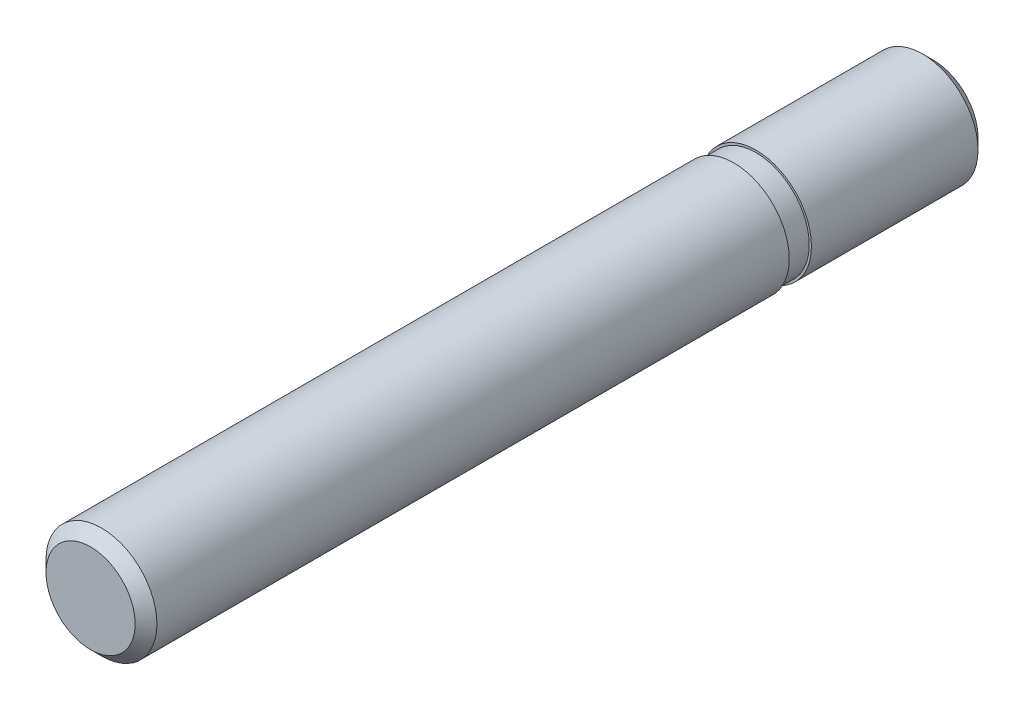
ISO-10303-21;
HEADER;
FILE_DESCRIPTION(('STEP AP214'),'2;1');
FILE_NAME('part.step','',(''),(''),'','','');
FILE_SCHEMA(('AUTOMOTIVE_DESIGN { 1 0 10303 214 1 1 1 1 }'));
ENDSEC;
DATA;
#1=APPLICATION_CONTEXT('core data for automotive mechanical design processes');
#2=APPLICATION_PROTOCOL_DEFINITION('international standard','automotive_design',2000,#1);
#3=PRODUCT_CONTEXT('',#1,'mechanical');
#4=PRODUCT('Part','Part','',(#3));
#5=PRODUCT_RELATED_PRODUCT_CATEGORY('part','',(#4));
#6=PRODUCT_DEFINITION_FORMATION('','',#4);
#7=PRODUCT_DEFINITION_CONTEXT('part definition',#1,'design');
#8=PRODUCT_DEFINITION('design','',#6,#7);
#9=PRODUCT_DEFINITION_SHAPE('','',#8);
#10=(LENGTH_UNIT() NAMED_UNIT(*) SI_UNIT(.MILLI.,.METRE.));
#11=(NAMED_UNIT(*) PLANE_ANGLE_UNIT() SI_UNIT($,.RADIAN.));
#12=(NAMED_UNIT(*) SI_UNIT($,.STERADIAN.) SOLID_ANGLE_UNIT());
#13=UNCERTAINTY_MEASURE_WITH_UNIT(LENGTH_MEASURE(1.E-05),#10,'distance_accuracy_value','');
#14=(GEOMETRIC_REPRESENTATION_CONTEXT(3) GLOBAL_UNCERTAINTY_ASSIGNED_CONTEXT((#13)) GLOBAL_UNIT_ASSIGNED_CONTEXT((#10,
#11,#12)) REPRESENTATION_CONTEXT('',''));
#15=CARTESIAN_POINT('',(0.,0.,0.));
#16=DIRECTION('',(0.,0.,1.));
#17=DIRECTION('',(1.,0.,0.));
#18=AXIS2_PLACEMENT_3D('',#15,#16,#17);
#19=CARTESIAN_POINT('',(0.,1.00475,-8.));
#20=DIRECTION('',(0.,0.,-1.));
#21=DIRECTION('',(-1.,0.,0.));
#22=AXIS2_PLACEMENT_3D('',#19,#20,#21);
#23=PLANE('',#22);
#24=CARTESIAN_POINT('',(0.,0.,-8.00000000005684));
#25=DIRECTION('',(0.,0.,1.));
#26=DIRECTION('',(1.,0.,0.));
#27=AXIS2_PLACEMENT_3D('',#24,#25,#26);
#28=CIRCLE('',#27,2.00949999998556);
#29=CARTESIAN_POINT('',(2.00949999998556,0.,-8.00000000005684));
#30=VERTEX_POINT('',#29);
#31=EDGE_CURVE('E19',#30,#30,#28,.T.);
#32=ORIENTED_EDGE('',*,*,#31,.F.);
#33=EDGE_LOOP('',(#32));
#34=FACE_BOUND('',#33,.T.);
#35=ADVANCED_FACE('F12',(#34),#23,.T.);
#36=CARTESIAN_POINT('',(0.,0.,-7.50950000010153));
#37=DIRECTION('',(0.,0.,1.));
#38=DIRECTION('',(1.,0.,0.));
#39=AXIS2_PLACEMENT_3D('',#36,#37,#38);
#40=CONICAL_SURFACE('',#39,2.49999999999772,0.785398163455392);
#41=CARTESIAN_POINT('',(0.,0.,-7.5095));
#42=DIRECTION('',(0.,0.,1.));
#43=DIRECTION('',(1.,0.,0.));
#44=AXIS2_PLACEMENT_3D('',#41,#42,#43);
#45=CIRCLE('',#44,2.5);
#46=CARTESIAN_POINT('',(2.5,0.,-7.5095));
#47=VERTEX_POINT('',#46);
#48=EDGE_CURVE('E23',#47,#47,#45,.T.);
#49=ORIENTED_EDGE('',*,*,#48,.F.);
#50=EDGE_LOOP('',(#49));
#51=FACE_BOUND('',#50,.T.);
#52=ORIENTED_EDGE('',*,*,#31,.T.);
#53=EDGE_LOOP('',(#52));
#54=FACE_BOUND('',#53,.T.);
#55=ADVANCED_FACE('F63',(#51,#54),#40,.T.);
#56=CARTESIAN_POINT('',(0.,0.,6.5));
#57=DIRECTION('',(0.,0.,1.));
#58=DIRECTION('',(1.,0.,0.));
#59=AXIS2_PLACEMENT_3D('',#56,#57,#58);
#60=CYLINDRICAL_SURFACE('',#59,2.5);
#61=CARTESIAN_POINT('',(0.,0.,0.));
#62=DIRECTION('',(0.,0.,1.));
#63=DIRECTION('',(1.,0.,0.));
#64=AXIS2_PLACEMENT_3D('',#61,#62,#63);
#65=CIRCLE('',#64,2.5);
#66=CARTESIAN_POINT('',(2.5,0.,0.));
#67=VERTEX_POINT('',#66);
#68=EDGE_CURVE('E28',#67,#67,#65,.T.);
#69=ORIENTED_EDGE('',*,*,#68,.F.);
#70=EDGE_LOOP('',(#69));
#71=FACE_BOUND('',#70,.T.);
#72=ORIENTED_EDGE('',*,*,#48,.T.);
#73=EDGE_LOOP('',(#72));
#74=FACE_BOUND('',#73,.T.);
#75=ADVANCED_FACE('F68',(#71,#74),#60,.T.);
#76=CARTESIAN_POINT('',(0.,0.,0.));
#77=DIRECTION('',(0.,0.,1.));
#78=DIRECTION('',(1.,0.,0.));
#79=AXIS2_PLACEMENT_3D('',#76,#77,#78);
#80=PLANE('',#79);
#81=CARTESIAN_POINT('',(0.,0.,0.));
#82=DIRECTION('',(0.,0.,1.));
#83=DIRECTION('',(1.,0.,0.));
#84=AXIS2_PLACEMENT_3D('',#81,#82,#83);
#85=CIRCLE('',#84,2.4);
#86=CARTESIAN_POINT('',(2.4,0.,0.));
#87=VERTEX_POINT('',#86);
#88=EDGE_CURVE('E8',#87,#87,#85,.T.);
#89=ORIENTED_EDGE('',*,*,#88,.F.);
#90=EDGE_LOOP('',(#89));
#91=FACE_BOUND('',#90,.T.);
#92=ORIENTED_EDGE('',*,*,#68,.T.);
#93=EDGE_LOOP('',(#92));
#94=FACE_BOUND('',#93,.T.);
#95=ADVANCED_FACE('F73',(#91,#94),#80,.T.);
#96=CARTESIAN_POINT('',(0.,0.,-1.83159535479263));
#97=DIRECTION('',(0.,0.,-1.));
#98=DIRECTION('',(-1.,0.,0.));
#99=AXIS2_PLACEMENT_3D('',#96,#97,#98);
#100=CYLINDRICAL_SURFACE('',#99,2.4);
#101=CARTESIAN_POINT('',(0.,0.,1.));
#102=DIRECTION('',(0.,0.,-1.));
#103=DIRECTION('',(-1.,0.,0.));
#104=AXIS2_PLACEMENT_3D('',#101,#102,#103);
#105=CIRCLE('',#104,2.4);
#106=CARTESIAN_POINT('',(-2.4,0.,1.));
#107=VERTEX_POINT('',#106);
#108=EDGE_CURVE('E44',#107,#107,#105,.T.);
#109=ORIENTED_EDGE('',*,*,#108,.T.);
#110=EDGE_LOOP('',(#109));
#111=FACE_BOUND('',#110,.T.);
#112=ORIENTED_EDGE('',*,*,#88,.T.);
#113=EDGE_LOOP('',(#112));
#114=FACE_BOUND('',#113,.T.);
#115=ADVANCED_FACE('F49',(#111,#114),#100,.T.);
#116=CARTESIAN_POINT('',(0.,1.00475,30.));
#117=DIRECTION('',(0.,0.,1.));
#118=DIRECTION('',(1.,0.,0.));
#119=AXIS2_PLACEMENT_3D('',#116,#117,#118);
#120=PLANE('',#119);
#121=CARTESIAN_POINT('',(0.,0.,30.0000000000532));
#122=DIRECTION('',(0.,0.,-1.));
#123=DIRECTION('',(-1.,0.,0.));
#124=AXIS2_PLACEMENT_3D('',#121,#122,#123);
#125=CIRCLE('',#124,2.00949999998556);
#126=CARTESIAN_POINT('',(-2.00949999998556,0.,30.0000000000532));
#127=VERTEX_POINT('',#126);
#128=EDGE_CURVE('E31',#127,#127,#125,.T.);
#129=ORIENTED_EDGE('',*,*,#128,.F.);
#130=EDGE_LOOP('',(#129));
#131=FACE_BOUND('',#130,.T.);
#132=ADVANCED_FACE('F80',(#131),#120,.T.);
#133=CARTESIAN_POINT('',(0.,0.,29.5095000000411));
#134=DIRECTION('',(0.,0.,-1.));
#135=DIRECTION('',(-1.,0.,0.));
#136=AXIS2_PLACEMENT_3D('',#133,#134,#135);
#137=CONICAL_SURFACE('',#136,2.50000000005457,0.785398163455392);
#138=ORIENTED_EDGE('',*,*,#128,.T.);
#139=EDGE_LOOP('',(#138));
#140=FACE_BOUND('',#139,.T.);
#141=CARTESIAN_POINT('',(0.,0.,29.5095));
#142=DIRECTION('',(0.,0.,1.));
#143=DIRECTION('',(1.,0.,0.));
#144=AXIS2_PLACEMENT_3D('',#141,#142,#143);
#145=CIRCLE('',#144,2.5);
#146=CARTESIAN_POINT('',(2.5,0.,29.5095));
#147=VERTEX_POINT('',#146);
#148=EDGE_CURVE('E37',#147,#147,#145,.F.);
#149=ORIENTED_EDGE('',*,*,#148,.F.);
#150=EDGE_LOOP('',(#149));
#151=FACE_BOUND('',#150,.T.);
#152=ADVANCED_FACE('F59',(#140,#151),#137,.T.);
#153=CARTESIAN_POINT('',(0.,0.,6.5));
#154=DIRECTION('',(0.,0.,1.));
#155=DIRECTION('',(1.,0.,0.));
#156=AXIS2_PLACEMENT_3D('',#153,#154,#155);
#157=CYLINDRICAL_SURFACE('',#156,2.5);
#158=CARTESIAN_POINT('',(0.,0.,1.));
#159=DIRECTION('',(0.,0.,1.));
#160=DIRECTION('',(1.,0.,0.));
#161=AXIS2_PLACEMENT_3D('',#158,#159,#160);
#162=CIRCLE('',#161,2.5);
#163=CARTESIAN_POINT('',(2.5,0.,1.));
#164=VERTEX_POINT('',#163);
#165=EDGE_CURVE('E35',#164,#164,#162,.T.);
#166=ORIENTED_EDGE('',*,*,#165,.T.);
#167=EDGE_LOOP('',(#166));
#168=FACE_BOUND('',#167,.T.);
#169=ORIENTED_EDGE('',*,*,#148,.T.);
#170=EDGE_LOOP('',(#169));
#171=FACE_BOUND('',#170,.T.);
#172=ADVANCED_FACE('F14',(#168,#171),#157,.T.);
#173=CARTESIAN_POINT('',(0.,0.,1.));
#174=DIRECTION('',(0.,0.,1.));
#175=DIRECTION('',(1.,0.,0.));
#176=AXIS2_PLACEMENT_3D('',#173,#174,#175);
#177=PLANE('',#176);
#178=ORIENTED_EDGE('',*,*,#108,.F.);
#179=EDGE_LOOP('',(#178));
#180=FACE_BOUND('',#179,.T.);
#181=ORIENTED_EDGE('',*,*,#165,.F.);
#182=EDGE_LOOP('',(#181));
#183=FACE_BOUND('',#182,.T.);
#184=ADVANCED_FACE('F51',(#180,#183),#177,.F.);
#185=CLOSED_SHELL('',(#35,#55,#75,#95,#115,#132,#152,#172,#184));
#186=MANIFOLD_SOLID_BREP('B1',#185);
#187=ADVANCED_BREP_SHAPE_REPRESENTATION('',(#18,#186),#14);
#188=SHAPE_DEFINITION_REPRESENTATION(#9,#187);
ENDSEC;
END-ISO-10303-21;
